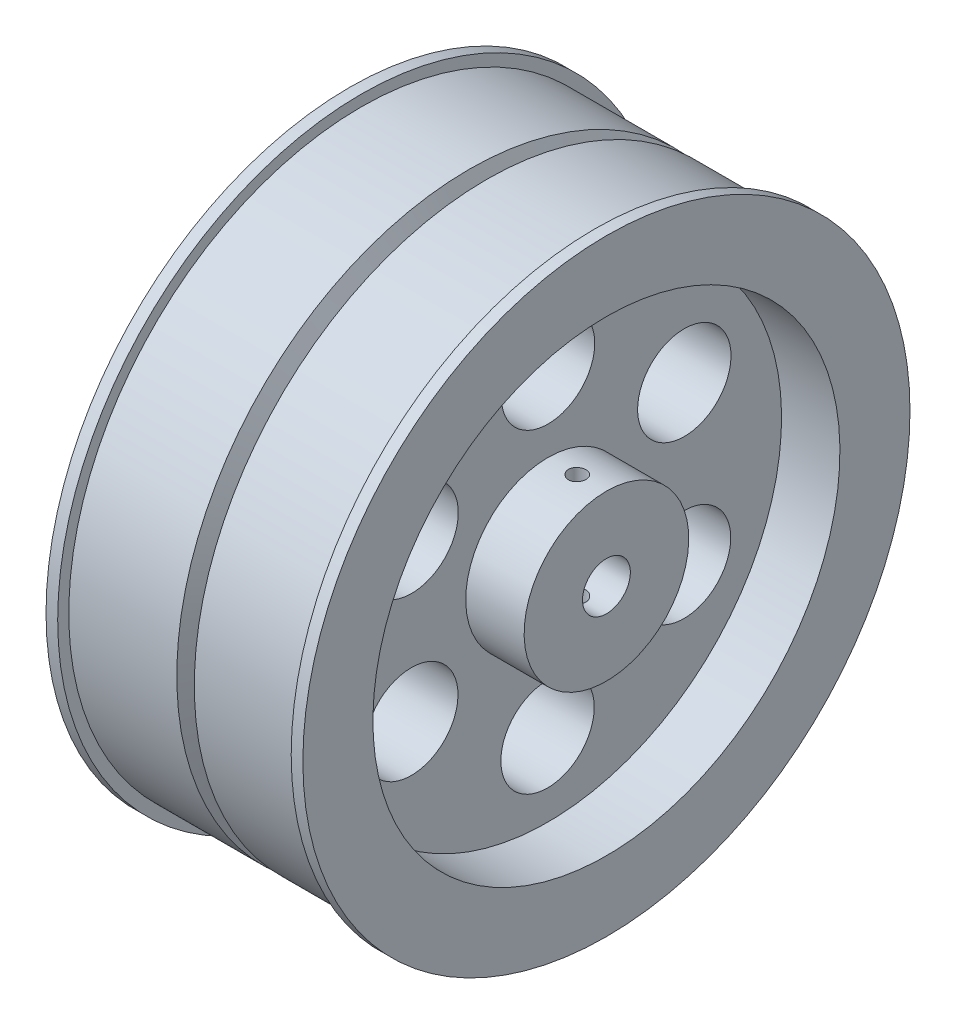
ISO-10303-21;
HEADER;
FILE_DESCRIPTION(('STEP AP214'),'2;1');
FILE_NAME('part.step','',(''),(''),'','','');
FILE_SCHEMA(('AUTOMOTIVE_DESIGN { 1 0 10303 214 1 1 1 1 }'));
ENDSEC;
DATA;
#1=APPLICATION_CONTEXT('core data for automotive mechanical design processes');
#2=APPLICATION_PROTOCOL_DEFINITION('international standard','automotive_design',2000,#1);
#3=PRODUCT_CONTEXT('',#1,'mechanical');
#4=PRODUCT('Part','Part','',(#3));
#5=PRODUCT_RELATED_PRODUCT_CATEGORY('part','',(#4));
#6=PRODUCT_DEFINITION_FORMATION('','',#4);
#7=PRODUCT_DEFINITION_CONTEXT('part definition',#1,'design');
#8=PRODUCT_DEFINITION('design','',#6,#7);
#9=PRODUCT_DEFINITION_SHAPE('','',#8);
#10=(LENGTH_UNIT() NAMED_UNIT(*) SI_UNIT(.MILLI.,.METRE.));
#11=(NAMED_UNIT(*) PLANE_ANGLE_UNIT() SI_UNIT($,.RADIAN.));
#12=(NAMED_UNIT(*) SI_UNIT($,.STERADIAN.) SOLID_ANGLE_UNIT());
#13=UNCERTAINTY_MEASURE_WITH_UNIT(LENGTH_MEASURE(1.E-05),#10,'distance_accuracy_value','');
#14=(GEOMETRIC_REPRESENTATION_CONTEXT(3) GLOBAL_UNCERTAINTY_ASSIGNED_CONTEXT((#13)) GLOBAL_UNIT_ASSIGNED_CONTEXT((#10,
#11,#12)) REPRESENTATION_CONTEXT('',''));
#15=CARTESIAN_POINT('',(0.,0.,0.));
#16=DIRECTION('',(0.,0.,1.));
#17=DIRECTION('',(1.,0.,0.));
#18=AXIS2_PLACEMENT_3D('',#15,#16,#17);
#19=CARTESIAN_POINT('',(44.,-4.09999999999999,0.));
#20=DIRECTION('',(1.,0.,0.));
#21=DIRECTION('',(0.,1.,0.));
#22=AXIS2_PLACEMENT_3D('',#19,#20,#21);
#23=CYLINDRICAL_SURFACE('',#22,4.1);
#24=CARTESIAN_POINT('',(39.0169354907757,-7.91575680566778,-1.5));
#25=CARTESIAN_POINT('',(39.0981031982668,-7.91575467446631,-1.50000235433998));
#26=CARTESIAN_POINT('',(39.1792549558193,-7.91837484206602,-1.49338979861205));
#27=CARTESIAN_POINT('',(39.339121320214,-7.92850330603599,-1.46722747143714));
#28=CARTESIAN_POINT('',(39.4178359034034,-7.93601164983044,-1.4476775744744));
#29=CARTESIAN_POINT('',(39.5704779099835,-7.95495455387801,-1.39644599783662));
#30=CARTESIAN_POINT('',(39.6444158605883,-7.96638010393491,-1.36479214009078));
#31=CARTESIAN_POINT('',(39.7859598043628,-7.991855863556,-1.29034903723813));
#32=CARTESIAN_POINT('',(39.8535639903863,-8.00590681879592,-1.24755662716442));
#33=CARTESIAN_POINT('',(39.9837165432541,-8.03579442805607,-1.14988485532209));
#34=CARTESIAN_POINT('',(40.0459229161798,-8.05168186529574,-1.09456519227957));
#35=CARTESIAN_POINT('',(40.1604148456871,-8.08302744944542,-0.97434468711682));
#36=CARTESIAN_POINT('',(40.21269841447,-8.0984855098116,-0.909441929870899));
#37=CARTESIAN_POINT('',(40.3074858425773,-8.12783066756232,-0.769323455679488));
#38=CARTESIAN_POINT('',(40.3496210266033,-8.14165123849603,-0.693843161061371));
#39=CARTESIAN_POINT('',(40.4204550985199,-8.16555657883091,-0.53627123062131));
#40=CARTESIAN_POINT('',(40.4491584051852,-8.17564257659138,-0.454181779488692));
#41=CARTESIAN_POINT('',(40.4911236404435,-8.1905820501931,-0.289315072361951));
#42=CARTESIAN_POINT('',(40.5049736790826,-8.19563420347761,-0.206705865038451));
#43=CARTESIAN_POINT('',(40.518720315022,-8.2006479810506,-0.0401915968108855));
#44=CARTESIAN_POINT('',(40.5186212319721,-8.20061118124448,0.0437130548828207));
#45=CARTESIAN_POINT('',(40.5048219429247,-8.19557948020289,0.206233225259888));
#46=CARTESIAN_POINT('',(40.4917629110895,-8.19081831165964,0.284911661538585));
#47=CARTESIAN_POINT('',(40.4534887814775,-8.17717640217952,0.438871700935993));
#48=CARTESIAN_POINT('',(40.4282728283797,-8.16829537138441,0.514153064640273));
#49=CARTESIAN_POINT('',(40.3660859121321,-8.14714008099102,0.660456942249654));
#50=CARTESIAN_POINT('',(40.328952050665,-8.13481912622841,0.731403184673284));
#51=CARTESIAN_POINT('',(40.2441250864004,-8.10803906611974,0.866230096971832));
#52=CARTESIAN_POINT('',(40.1964286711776,-8.09357929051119,0.930108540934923));
#53=CARTESIAN_POINT('',(40.0887080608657,-8.06306510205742,1.05277373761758));
#54=CARTESIAN_POINT('',(40.0281434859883,-8.04696673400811,1.11107573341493));
#55=CARTESIAN_POINT('',(39.8979899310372,-8.01564460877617,1.21687247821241));
#56=CARTESIAN_POINT('',(39.82839890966,-8.00042105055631,1.26436477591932));
#57=CARTESIAN_POINT('',(39.6803427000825,-7.97230316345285,1.34805926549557));
#58=CARTESIAN_POINT('',(39.6017264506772,-7.95946219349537,1.38401358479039));
#59=CARTESIAN_POINT('',(39.4389625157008,-7.93817916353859,1.44199376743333));
#60=CARTESIAN_POINT('',(39.3548177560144,-7.92973479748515,1.46402693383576));
#61=CARTESIAN_POINT('',(39.1881562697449,-7.91873991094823,1.49246340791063));
#62=CARTESIAN_POINT('',(39.1057893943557,-7.91590089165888,1.49963279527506));
#63=CARTESIAN_POINT('',(38.9409985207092,-7.9156236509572,1.50033939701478));
#64=CARTESIAN_POINT('',(38.8585745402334,-7.91818417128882,1.49387978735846));
#65=CARTESIAN_POINT('',(38.699832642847,-7.92812567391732,1.46820510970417));
#66=CARTESIAN_POINT('',(38.6234059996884,-7.93528801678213,1.44956796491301));
#67=CARTESIAN_POINT('',(38.4747947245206,-7.95337108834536,1.40078660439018));
#68=CARTESIAN_POINT('',(38.4026109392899,-7.9642925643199,1.37064010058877));
#69=CARTESIAN_POINT('',(38.2616249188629,-7.98915142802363,1.29846231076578));
#70=CARTESIAN_POINT('',(38.1930403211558,-8.00318384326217,1.25603958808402));
#71=CARTESIAN_POINT('',(38.0636900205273,-8.03251834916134,1.16093603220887));
#72=CARTESIAN_POINT('',(38.0029270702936,-8.04782088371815,1.10825160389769));
#73=CARTESIAN_POINT('',(37.8871779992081,-8.07907771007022,0.990388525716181));
#74=CARTESIAN_POINT('',(37.8327547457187,-8.09501624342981,0.924651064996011));
#75=CARTESIAN_POINT('',(37.7356516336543,-8.12486628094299,0.784583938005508));
#76=CARTESIAN_POINT('',(37.6929716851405,-8.13877780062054,0.7102543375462));
#77=CARTESIAN_POINT('',(37.6208807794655,-8.16298131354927,0.55524929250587));
#78=CARTESIAN_POINT('',(37.5914125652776,-8.17328888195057,0.474603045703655));
#79=CARTESIAN_POINT('',(37.546615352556,-8.18918053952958,0.309037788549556));
#80=CARTESIAN_POINT('',(37.5312800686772,-8.19476672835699,0.224120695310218));
#81=CARTESIAN_POINT('',(37.5158370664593,-8.20039636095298,0.0575246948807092));
#82=CARTESIAN_POINT('',(37.5149279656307,-8.20073149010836,-0.0240707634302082));
#83=CARTESIAN_POINT('',(37.5263210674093,-8.19657209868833,-0.18620018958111));
#84=CARTESIAN_POINT('',(37.5386218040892,-8.19207811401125,-0.266734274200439));
#85=CARTESIAN_POINT('',(37.5755281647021,-8.17889309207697,-0.422636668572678));
#86=CARTESIAN_POINT('',(37.599853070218,-8.17029795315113,-0.498080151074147));
#87=CARTESIAN_POINT('',(37.6598427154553,-8.1498035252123,-0.643827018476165));
#88=CARTESIAN_POINT('',(37.6955095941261,-8.13790361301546,-0.714129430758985));
#89=CARTESIAN_POINT('',(37.7788415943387,-8.11139072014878,-0.850756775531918));
#90=CARTESIAN_POINT('',(37.8269392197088,-8.09668640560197,-0.916799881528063));
#91=CARTESIAN_POINT('',(37.9330737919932,-8.06638021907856,-1.04012881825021));
#92=CARTESIAN_POINT('',(37.9911142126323,-8.05077803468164,-1.09741157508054));
#93=CARTESIAN_POINT('',(38.118915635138,-8.01949238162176,-1.20451181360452));
#94=CARTESIAN_POINT('',(38.1891153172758,-8.00384329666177,-1.25381781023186));
#95=CARTESIAN_POINT('',(38.3373000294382,-7.97512980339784,-1.33993960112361));
#96=CARTESIAN_POINT('',(38.4152851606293,-7.962065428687,-1.37675523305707));
#97=CARTESIAN_POINT('',(38.5788554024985,-7.93994967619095,-1.43731022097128));
#98=CARTESIAN_POINT('',(38.664574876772,-7.93099845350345,-1.46072632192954));
#99=CARTESIAN_POINT('',(38.8391823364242,-7.91890485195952,-1.49206547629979));
#100=CARTESIAN_POINT('',(38.9280684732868,-7.91575913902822,-1.49999742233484));
#101=CARTESIAN_POINT('',(39.0169354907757,-7.91575680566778,-1.5));
#102=B_SPLINE_CURVE_WITH_KNOTS('',3,(#24,#25,#26,#27,#28,#29,#30,#31,#32,#33,#34,#35,#36,#37,
#38,#39,#40,#41,#42,#43,#44,#45,#46,#47,#48,#49,#50,#51,#52,#53,#54,#55,#56,#57,#58,#59,#60,#61,
#62,#63,#64,#65,#66,#67,#68,#69,#70,#71,#72,#73,#74,#75,#76,#77,#78,#79,#80,#81,#82,#83,#84,#85,
#86,#87,#88,#89,#90,#91,#92,#93,#94,#95,#96,#97,#98,#99,#100,#101),.UNSPECIFIED.,.T.,.F.,(4,2,2,
2,2,2,2,2,2,2,2,2,2,2,2,2,2,2,2,2,2,2,2,2,2,2,2,2,2,2,2,2,2,2,2,2,2,2,4),(0.,0.243172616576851,
0.486347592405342,0.728966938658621,0.971655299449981,1.22477018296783,1.47793571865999,
1.73924469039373,2.00046763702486,2.25091526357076,2.5012853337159,2.73985669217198,
2.97844483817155,3.22044388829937,3.46251893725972,3.71813633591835,3.9738116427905,
4.23465998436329,4.4953713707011,4.74227312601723,4.98911735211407,5.22502305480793,
5.46097568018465,5.70548712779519,5.95008439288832,6.20931086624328,6.46853535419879,
6.7266252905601,6.98460039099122,7.22819130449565,7.47175518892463,7.70988376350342,
7.94805727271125,8.1960098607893,8.44404925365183,8.70439673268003,8.96474759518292,
9.23113982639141,9.49737902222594),.UNSPECIFIED.);
#103=CARTESIAN_POINT('',(39.0169354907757,-7.91575680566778,-1.5));
#104=VERTEX_POINT('',#103);
#105=EDGE_CURVE('E86',#104,#104,#102,.T.);
#106=ORIENTED_EDGE('',*,*,#105,.T.);
#107=EDGE_LOOP('',(#106));
#108=FACE_BOUND('',#107,.T.);
#109=CARTESIAN_POINT('',(44.,-4.09999999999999,0.));
#110=DIRECTION('',(1.,0.,0.));
#111=DIRECTION('',(0.,1.,0.));
#112=AXIS2_PLACEMENT_3D('',#109,#110,#111);
#113=CIRCLE('',#112,4.1);
#114=CARTESIAN_POINT('',(44.,0.,0.));
#115=VERTEX_POINT('',#114);
#116=EDGE_CURVE('E147',#115,#115,#113,.T.);
#117=ORIENTED_EDGE('',*,*,#116,.T.);
#118=EDGE_LOOP('',(#117));
#119=FACE_BOUND('',#118,.T.);
#120=CARTESIAN_POINT('',(0.,-4.1,0.));
#121=DIRECTION('',(1.,0.,0.));
#122=DIRECTION('',(0.,1.,0.));
#123=AXIS2_PLACEMENT_3D('',#120,#121,#122);
#124=CIRCLE('',#123,4.1);
#125=CARTESIAN_POINT('',(0.,0.,0.));
#126=VERTEX_POINT('',#125);
#127=EDGE_CURVE('E57',#126,#126,#124,.T.);
#128=ORIENTED_EDGE('',*,*,#127,.F.);
#129=EDGE_LOOP('',(#128));
#130=FACE_BOUND('',#129,.T.);
#131=CARTESIAN_POINT('',(37.5169354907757,0.,0.));
#132=CARTESIAN_POINT('',(37.5169332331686,1.65923337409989E-06,0.0813740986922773));
#133=CARTESIAN_POINT('',(37.5235781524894,-0.0024439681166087,0.162732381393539));
#134=CARTESIAN_POINT('',(37.5498807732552,-0.0119565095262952,0.323025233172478));
#135=CARTESIAN_POINT('',(37.5695373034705,-0.0190230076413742,0.401960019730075));
#136=CARTESIAN_POINT('',(37.6210801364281,-0.0370166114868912,0.555071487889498));
#137=CARTESIAN_POINT('',(37.6529435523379,-0.047936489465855,0.629256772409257));
#138=CARTESIAN_POINT('',(37.7278822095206,-0.0725431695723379,0.771225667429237));
#139=CARTESIAN_POINT('',(37.7709602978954,-0.0862306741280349,0.839007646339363));
#140=CARTESIAN_POINT('',(37.868939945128,-0.115576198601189,0.969005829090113));
#141=CARTESIAN_POINT('',(37.9242174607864,-0.131288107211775,1.03092640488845));
#142=CARTESIAN_POINT('',(38.0442285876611,-0.162639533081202,1.14485387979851));
#143=CARTESIAN_POINT('',(38.1089648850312,-0.178279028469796,1.196857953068));
#144=CARTESIAN_POINT('',(38.2488921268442,-0.208333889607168,1.29131121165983));
#145=CARTESIAN_POINT('',(38.3243749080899,-0.222685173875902,1.333350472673));
#146=CARTESIAN_POINT('',(38.4819477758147,-0.247704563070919,1.40400686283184));
#147=CARTESIAN_POINT('',(38.5640353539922,-0.258374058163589,1.43262905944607));
#148=CARTESIAN_POINT('',(38.7290923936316,-0.274247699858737,1.47448484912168));
#149=CARTESIAN_POINT('',(38.8118995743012,-0.279650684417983,1.48828050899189));
#150=CARTESIAN_POINT('',(38.9788162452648,-0.284962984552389,1.50184918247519));
#151=CARTESIAN_POINT('',(39.0629252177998,-0.284874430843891,1.50162763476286));
#152=CARTESIAN_POINT('',(39.2249991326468,-0.279385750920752,1.48759945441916));
#153=CARTESIAN_POINT('',(39.3030426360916,-0.2742861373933,1.47456140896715));
#154=CARTESIAN_POINT('',(39.455745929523,-0.259847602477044,1.43653709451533));
#155=CARTESIAN_POINT('',(39.5304052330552,-0.250508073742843,1.41154911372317));
#156=CARTESIAN_POINT('',(39.6758278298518,-0.22845373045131,1.34989422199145));
#157=CARTESIAN_POINT('',(39.7464946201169,-0.215680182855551,1.31302162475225));
#158=CARTESIAN_POINT('',(39.8808653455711,-0.188217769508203,1.22878734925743));
#159=CARTESIAN_POINT('',(39.9445669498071,-0.173528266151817,1.18142217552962));
#160=CARTESIAN_POINT('',(40.0674688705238,-0.142746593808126,1.0739910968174));
#161=CARTESIAN_POINT('',(40.1261236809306,-0.126624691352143,1.01330819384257));
#162=CARTESIAN_POINT('',(40.2325820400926,-0.0956026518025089,0.882778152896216));
#163=CARTESIAN_POINT('',(40.2803840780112,-0.0807026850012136,0.812929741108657));
#164=CARTESIAN_POINT('',(40.3643431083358,-0.0535320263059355,0.664714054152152));
#165=CARTESIAN_POINT('',(40.4003266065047,-0.0413013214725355,0.586240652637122));
#166=CARTESIAN_POINT('',(40.4584028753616,-0.0211421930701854,0.423796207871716));
#167=CARTESIAN_POINT('',(40.4805015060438,-0.013211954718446,0.339827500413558));
#168=CARTESIAN_POINT('',(40.5091509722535,-0.00286211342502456,0.173373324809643));
#169=CARTESIAN_POINT('',(40.5164369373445,-0.000182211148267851,0.0910304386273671));
#170=CARTESIAN_POINT('',(40.5173841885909,0.000163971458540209,-0.0737349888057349));
#171=CARTESIAN_POINT('',(40.5110483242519,-0.00216869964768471,-0.156157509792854));
#172=CARTESIAN_POINT('',(40.4854962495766,-0.0114136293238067,-0.31561968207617));
#173=CARTESIAN_POINT('',(40.4667546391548,-0.0181570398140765,-0.3927461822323));
#174=CARTESIAN_POINT('',(40.417540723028,-0.0353762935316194,-0.542711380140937));
#175=CARTESIAN_POINT('',(40.3870668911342,-0.0458526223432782,-0.615549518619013));
#176=CARTESIAN_POINT('',(40.3142957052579,-0.0698718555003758,-0.757219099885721));
#177=CARTESIAN_POINT('',(40.2716829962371,-0.0834944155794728,-0.825874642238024));
#178=CARTESIAN_POINT('',(40.1762030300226,-0.112289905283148,-0.955285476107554));
#179=CARTESIAN_POINT('',(40.1233321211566,-0.127463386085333,-1.01603794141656));
#180=CARTESIAN_POINT('',(40.0054004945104,-0.158723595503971,-1.13141965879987));
#181=CARTESIAN_POINT('',(39.9398282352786,-0.174814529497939,-1.18552627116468));
#182=CARTESIAN_POINT('',(39.8002099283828,-0.2052745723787,-1.28206233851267));
#183=CARTESIAN_POINT('',(39.7261633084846,-0.219643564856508,-1.3244910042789));
#184=CARTESIAN_POINT('',(39.5712398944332,-0.244949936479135,-1.39644382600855));
#185=CARTESIAN_POINT('',(39.4903465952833,-0.255878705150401,-1.42593567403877));
#186=CARTESIAN_POINT('',(39.3242344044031,-0.272777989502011,-1.47069890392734));
#187=CARTESIAN_POINT('',(39.2390180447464,-0.278751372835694,-1.48597851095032));
#188=CARTESIAN_POINT('',(39.0723108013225,-0.284694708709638,-1.50116808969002));
#189=CARTESIAN_POINT('',(38.9909122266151,-0.285010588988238,-1.50196373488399));
#190=CARTESIAN_POINT('',(38.829207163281,-0.280482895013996,-1.4904116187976));
#191=CARTESIAN_POINT('',(38.7489005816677,-0.275639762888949,-1.47806498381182));
#192=CARTESIAN_POINT('',(38.5939030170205,-0.261621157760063,-1.44125524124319));
#193=CARTESIAN_POINT('',(38.5191181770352,-0.252569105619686,-1.41713639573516));
#194=CARTESIAN_POINT('',(38.3746089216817,-0.231218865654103,-1.35776394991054));
#195=CARTESIAN_POINT('',(38.3048857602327,-0.218919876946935,-1.32250760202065));
#196=CARTESIAN_POINT('',(38.1686499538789,-0.191687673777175,-1.23979005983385));
#197=CARTESIAN_POINT('',(38.1024777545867,-0.176652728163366,-1.19180200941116));
#198=CARTESIAN_POINT('',(37.9788415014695,-0.146009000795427,-1.08581555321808));
#199=CARTESIAN_POINT('',(37.9213801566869,-0.130400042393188,-1.02781404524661));
#200=CARTESIAN_POINT('',(37.81384545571,-0.0994203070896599,-0.899942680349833));
#201=CARTESIAN_POINT('',(37.7642916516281,-0.0841013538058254,-0.82962142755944));
#202=CARTESIAN_POINT('',(37.6777321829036,-0.0562664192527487,-0.681116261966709));
#203=CARTESIAN_POINT('',(37.6407264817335,-0.0437504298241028,-0.602932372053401));
#204=CARTESIAN_POINT('',(37.5798828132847,-0.022711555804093,-0.438970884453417));
#205=CARTESIAN_POINT('',(37.5563673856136,-0.0142871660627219,-0.353059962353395));
#206=CARTESIAN_POINT('',(37.524898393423,-0.00293350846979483,-0.178092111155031));
#207=CARTESIAN_POINT('',(37.5169379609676,-1.81547298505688E-06,-0.0890365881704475));
#208=CARTESIAN_POINT('',(37.5169354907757,0.,0.));
#209=B_SPLINE_CURVE_WITH_KNOTS('',3,(#131,#132,#133,#134,#135,#136,#137,#138,#139,#140,#141,
#142,#143,#144,#145,#146,#147,#148,#149,#150,#151,#152,#153,#154,#155,#156,#157,#158,#159,#160,
#161,#162,#163,#164,#165,#166,#167,#168,#169,#170,#171,#172,#173,#174,#175,#176,#177,#178,#179,
#180,#181,#182,#183,#184,#185,#186,#187,#188,#189,#190,#191,#192,#193,#194,#195,#196,#197,#198,
#199,#200,#201,#202,#203,#204,#205,#206,#207,#208),.UNSPECIFIED.,.T.,.F.,(4,2,2,2,2,2,2,2,2,2,2,
2,2,2,2,2,2,2,2,2,2,2,2,2,2,2,2,2,2,2,2,2,2,2,2,2,2,2,4),(0.,0.243794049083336,
0.487566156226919,0.730883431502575,0.97426253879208,1.22657525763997,1.4789597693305,
1.74040261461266,2.00174663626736,2.25278996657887,2.50373589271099,2.74049742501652,
2.97729288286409,3.21842895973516,3.45964548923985,3.71623310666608,3.97285642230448,
4.23309408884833,4.49322185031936,4.74008954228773,4.98690559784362,5.22478638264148,
5.46269812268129,5.70746441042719,5.95231798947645,6.21067838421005,6.46905623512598,
6.72807572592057,6.9869452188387,7.22992815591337,7.47289027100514,7.70913823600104,
7.94544452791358,8.1936958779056,8.44202427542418,8.70289171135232,8.9637583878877,
9.2306268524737,9.49737746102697),.UNSPECIFIED.);
#210=CARTESIAN_POINT('',(37.5169354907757,0.,0.));
#211=VERTEX_POINT('',#210);
#212=EDGE_CURVE('E92',#211,#211,#209,.T.);
#213=ORIENTED_EDGE('',*,*,#212,.T.);
#214=EDGE_LOOP('',(#213));
#215=FACE_BOUND('',#214,.T.);
#216=ADVANCED_FACE('F43',(#108,#119,#130,#215),#23,.F.);
#217=CARTESIAN_POINT('',(44.,-4.09999999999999,0.));
#218=DIRECTION('',(1.,0.,0.));
#219=DIRECTION('',(0.,1.,0.));
#220=AXIS2_PLACEMENT_3D('',#217,#218,#219);
#221=CYLINDRICAL_SURFACE('',#220,14.1);
#222=CARTESIAN_POINT('',(37.5169354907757,10.,0.));
#223=CARTESIAN_POINT('',(37.516939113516,9.99999897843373,-0.0840010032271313));
#224=CARTESIAN_POINT('',(37.52401542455,9.99924137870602,-0.168056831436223));
#225=CARTESIAN_POINT('',(37.5521362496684,9.99629201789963,-0.33383610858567));
#226=CARTESIAN_POINT('',(37.5731959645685,9.99409869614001,-0.415556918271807));
#227=CARTESIAN_POINT('',(37.6286618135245,9.98852536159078,-0.574241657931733));
#228=CARTESIAN_POINT('',(37.6630596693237,9.98514608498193,-0.651208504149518));
#229=CARTESIAN_POINT('',(37.7442088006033,9.97757822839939,-0.798260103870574));
#230=CARTESIAN_POINT('',(37.7909576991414,9.97338980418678,-0.86834617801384));
#231=CARTESIAN_POINT('',(37.8956847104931,9.96465351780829,-0.999946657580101));
#232=CARTESIAN_POINT('',(37.9537026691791,9.96010441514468,-1.06142927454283));
#233=CARTESIAN_POINT('',(38.0792357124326,9.9511696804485,-1.17380421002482));
#234=CARTESIAN_POINT('',(38.146751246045,9.9467840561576,-1.22469602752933));
#235=CARTESIAN_POINT('',(38.2895638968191,9.93866029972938,-1.31455885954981));
#236=CARTESIAN_POINT('',(38.3648793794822,9.93492375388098,-1.35350084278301));
#237=CARTESIAN_POINT('',(38.5210269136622,9.92853688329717,-1.41817321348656));
#238=CARTESIAN_POINT('',(38.6018588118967,9.92588652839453,-1.44390396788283));
#239=CARTESIAN_POINT('',(38.7664188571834,9.92198352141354,-1.48132861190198));
#240=CARTESIAN_POINT('',(38.8501348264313,9.92072559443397,-1.49307548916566));
#241=CARTESIAN_POINT('',(39.0183587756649,9.91973356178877,-1.50236276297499));
#242=CARTESIAN_POINT('',(39.1028667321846,9.91999941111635,-1.49990357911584));
#243=CARTESIAN_POINT('',(39.2699095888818,9.92202007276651,-1.48089216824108));
#244=CARTESIAN_POINT('',(39.352451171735,9.9237687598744,-1.46439791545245));
#245=CARTESIAN_POINT('',(39.513587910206,9.92854850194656,-1.41787484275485));
#246=CARTESIAN_POINT('',(39.5921830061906,9.93157957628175,-1.38784581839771));
#247=CARTESIAN_POINT('',(39.7433781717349,9.93858959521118,-1.31504201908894));
#248=CARTESIAN_POINT('',(39.8159658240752,9.94257044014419,-1.27224164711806));
#249=CARTESIAN_POINT('',(39.9529496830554,9.95102989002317,-1.17512847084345));
#250=CARTESIAN_POINT('',(40.0173456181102,9.95550851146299,-1.12081528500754));
#251=CARTESIAN_POINT('',(40.1364548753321,9.96448617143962,-1.00189501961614));
#252=CARTESIAN_POINT('',(40.1911182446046,9.96898520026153,-0.9372378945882));
#253=CARTESIAN_POINT('',(40.2888230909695,9.97747568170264,-0.799638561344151));
#254=CARTESIAN_POINT('',(40.3318645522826,9.9814671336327,-0.726696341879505));
#255=CARTESIAN_POINT('',(40.4051022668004,9.98849429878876,-0.574561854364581));
#256=CARTESIAN_POINT('',(40.4352958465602,9.99152981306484,-0.495368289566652));
#257=CARTESIAN_POINT('',(40.4819433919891,9.99630111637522,-0.332996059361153));
#258=CARTESIAN_POINT('',(40.4983978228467,9.99803694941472,-0.249817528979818));
#259=CARTESIAN_POINT('',(40.5170362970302,10.0000076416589,-0.0822689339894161));
#260=CARTESIAN_POINT('',(40.519289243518,10.0002497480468,0.00209338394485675));
#261=CARTESIAN_POINT('',(40.5096419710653,9.99922517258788,0.169994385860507));
#262=CARTESIAN_POINT('',(40.4977419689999,9.99795851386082,0.253533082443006));
#263=CARTESIAN_POINT('',(40.4601837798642,9.99406334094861,0.417215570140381));
#264=CARTESIAN_POINT('',(40.4345579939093,9.99143803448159,0.497366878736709));
#265=CARTESIAN_POINT('',(40.3703090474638,9.98511993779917,0.652233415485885));
#266=CARTESIAN_POINT('',(40.3316855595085,9.98142712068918,0.726948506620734));
#267=CARTESIAN_POINT('',(40.242367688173,9.97336866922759,0.869132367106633));
#268=CARTESIAN_POINT('',(40.1916281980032,9.96900054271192,0.936572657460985));
#269=CARTESIAN_POINT('',(40.0795831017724,9.96008923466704,1.0620039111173));
#270=CARTESIAN_POINT('',(40.0182771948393,9.95554604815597,1.11999460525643));
#271=CARTESIAN_POINT('',(39.8865381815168,9.94677472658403,1.22512099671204));
#272=CARTESIAN_POINT('',(39.8160687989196,9.94254795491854,1.2722113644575));
#273=CARTESIAN_POINT('',(39.6681814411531,9.93490919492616,1.35388840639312));
#274=CARTESIAN_POINT('',(39.5907635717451,9.93149719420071,1.38847527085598));
#275=CARTESIAN_POINT('',(39.4313301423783,9.92588301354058,1.44408820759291));
#276=CARTESIAN_POINT('',(39.3493239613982,9.92367845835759,1.46514091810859));
#277=CARTESIAN_POINT('',(39.1829158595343,9.92072154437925,1.49317422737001));
#278=CARTESIAN_POINT('',(39.0985140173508,9.91996913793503,1.50015528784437));
#279=CARTESIAN_POINT('',(38.930161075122,9.920002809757,1.49984024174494));
#280=CARTESIAN_POINT('',(38.8462098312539,9.92078121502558,1.49261534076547));
#281=CARTESIAN_POINT('',(38.6807211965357,9.92377241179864,1.46424310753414));
#282=CARTESIAN_POINT('',(38.5991838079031,9.92598520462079,1.4430957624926));
#283=CARTESIAN_POINT('',(38.4408400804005,9.93159366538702,1.38749922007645));
#284=CARTESIAN_POINT('',(38.3640328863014,9.93498911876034,1.35305243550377));
#285=CARTESIAN_POINT('',(38.2172786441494,9.94258073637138,1.27184204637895));
#286=CARTESIAN_POINT('',(38.1473315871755,9.94677689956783,1.22507845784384));
#287=CARTESIAN_POINT('',(38.0159183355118,9.95552234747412,1.12029507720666));
#288=CARTESIAN_POINT('',(37.9544945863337,9.96007323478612,1.06222218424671));
#289=CARTESIAN_POINT('',(37.8422338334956,9.96900081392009,0.936575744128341));
#290=CARTESIAN_POINT('',(37.7913993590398,9.97337746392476,0.868999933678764));
#291=CARTESIAN_POINT('',(37.7016450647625,9.98147646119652,0.726055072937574));
#292=CARTESIAN_POINT('',(37.6627591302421,9.98519693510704,0.65066465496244));
#293=CARTESIAN_POINT('',(37.5982513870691,9.99154445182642,0.494431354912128));
#294=CARTESIAN_POINT('',(37.5726147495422,9.99417271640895,0.413594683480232));
#295=CARTESIAN_POINT('',(37.5416663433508,9.99738552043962,0.27692434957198));
#296=CARTESIAN_POINT('',(37.5324050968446,9.99836133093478,0.221961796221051));
#297=CARTESIAN_POINT('',(37.5200384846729,9.9996689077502,0.11134085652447));
#298=CARTESIAN_POINT('',(37.5169330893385,10.0000006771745,0.0556824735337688));
#299=CARTESIAN_POINT('',(37.5169354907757,10.,0.));
#300=B_SPLINE_CURVE_WITH_KNOTS('',3,(#222,#223,#224,#225,#226,#227,#228,#229,#230,#231,#232,
#233,#234,#235,#236,#237,#238,#239,#240,#241,#242,#243,#244,#245,#246,#247,#248,#249,#250,#251,
#252,#253,#254,#255,#256,#257,#258,#259,#260,#261,#262,#263,#264,#265,#266,#267,#268,#269,#270,
#271,#272,#273,#274,#275,#276,#277,#278,#279,#280,#281,#282,#283,#284,#285,#286,#287,#288,#289,
#290,#291,#292,#293,#294,#295,#296,#297,#298,#299),.UNSPECIFIED.,.T.,.F.,(4,2,2,2,2,2,2,2,2,2,2,
2,2,2,2,2,2,2,2,2,2,2,2,2,2,2,2,2,2,2,2,2,2,2,2,2,2,2,4),(0.,0.251799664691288,
0.503873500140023,0.755791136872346,1.00766032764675,1.2604368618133,1.51322535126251,
1.76662319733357,2.02001400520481,2.27244157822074,2.52486169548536,2.77624418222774,
3.02763046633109,3.2795240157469,3.53142591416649,3.78458561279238,4.03774565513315,
4.2909583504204,4.54416247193,4.79613713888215,5.04810794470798,5.29948655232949,
5.55087149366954,5.80320732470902,6.05555034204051,6.30892460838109,6.56229501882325,
6.81516520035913,7.0680270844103,7.319624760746,7.57122266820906,7.82277495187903,
8.07432690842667,8.32708977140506,8.57991293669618,8.83344661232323,9.08669591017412,
9.2536093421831,9.42052196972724),.UNSPECIFIED.);
#301=CARTESIAN_POINT('',(37.5169354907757,10.,0.));
#302=VERTEX_POINT('',#301);
#303=EDGE_CURVE('E10',#302,#302,#300,.T.);
#304=ORIENTED_EDGE('',*,*,#303,.T.);
#305=EDGE_LOOP('',(#304));
#306=FACE_BOUND('',#305,.T.);
#307=CARTESIAN_POINT('',(44.,-4.09999999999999,0.));
#308=DIRECTION('',(1.,0.,0.));
#309=DIRECTION('',(0.,1.,0.));
#310=AXIS2_PLACEMENT_3D('',#307,#308,#309);
#311=CIRCLE('',#310,14.1);
#312=CARTESIAN_POINT('',(44.,10.,0.));
#313=VERTEX_POINT('',#312);
#314=EDGE_CURVE('E151',#313,#313,#311,.T.);
#315=ORIENTED_EDGE('',*,*,#314,.F.);
#316=EDGE_LOOP('',(#315));
#317=FACE_BOUND('',#316,.T.);
#318=CARTESIAN_POINT('',(34.,-4.1,0.));
#319=DIRECTION('',(1.,0.,0.));
#320=DIRECTION('',(0.,1.,0.));
#321=AXIS2_PLACEMENT_3D('',#318,#319,#320);
#322=CIRCLE('',#321,14.1);
#323=CARTESIAN_POINT('',(34.,10.,0.));
#324=VERTEX_POINT('',#323);
#325=EDGE_CURVE('E155',#324,#324,#322,.T.);
#326=ORIENTED_EDGE('',*,*,#325,.T.);
#327=EDGE_LOOP('',(#326));
#328=FACE_BOUND('',#327,.T.);
#329=CARTESIAN_POINT('',(39.0169354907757,-18.1199857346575,-1.5));
#330=CARTESIAN_POINT('',(38.9329360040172,-18.1199867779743,-1.49999637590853));
#331=CARTESIAN_POINT('',(38.8488816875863,-18.1207487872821,-1.49292031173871));
#332=CARTESIAN_POINT('',(38.6831055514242,-18.1237138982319,-1.4648005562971));
#333=CARTESIAN_POINT('',(38.6013863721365,-18.1259185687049,-1.44374165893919));
#334=CARTESIAN_POINT('',(38.4427050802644,-18.1315165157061,-1.38827820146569));
#335=CARTESIAN_POINT('',(38.3657400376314,-18.1349090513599,-1.35388195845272));
#336=CARTESIAN_POINT('',(38.2186914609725,-18.1424995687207,-1.27273662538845));
#337=CARTESIAN_POINT('',(38.1486066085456,-18.1466973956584,-1.22598990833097));
#338=CARTESIAN_POINT('',(38.0170047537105,-18.1554447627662,-1.12126510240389));
#339=CARTESIAN_POINT('',(37.9555199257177,-18.1599955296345,-1.06324668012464));
#340=CARTESIAN_POINT('',(37.8431407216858,-18.168924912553,-0.937711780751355));
#341=CARTESIAN_POINT('',(37.7922468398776,-18.1733035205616,-0.870194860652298));
#342=CARTESIAN_POINT('',(37.7023818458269,-18.181407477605,-0.727380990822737));
#343=CARTESIAN_POINT('',(37.6634393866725,-18.1851312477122,-0.652065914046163));
#344=CARTESIAN_POINT('',(37.5987660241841,-18.1914925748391,-0.495919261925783));
#345=CARTESIAN_POINT('',(37.5730347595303,-18.194130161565,-0.415087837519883));
#346=CARTESIAN_POINT('',(37.535609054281,-18.1980133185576,-0.250529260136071));
#347=CARTESIAN_POINT('',(37.5238615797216,-18.1992641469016,-0.166814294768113));
#348=CARTESIAN_POINT('',(37.5145727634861,-18.2002507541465,0.00140768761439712));
#349=CARTESIAN_POINT('',(37.5170310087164,-18.1999865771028,0.0859146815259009));
#350=CARTESIAN_POINT('',(37.536040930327,-18.1979772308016,0.252961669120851));
#351=CARTESIAN_POINT('',(37.5525355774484,-18.1962380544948,0.335508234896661));
#352=CARTESIAN_POINT('',(37.5990611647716,-18.1914809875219,0.496654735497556));
#353=CARTESIAN_POINT('',(37.6290923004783,-18.1884630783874,0.57525461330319));
#354=CARTESIAN_POINT('',(37.7019004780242,-18.1814774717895,0.726455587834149));
#355=CARTESIAN_POINT('',(37.74470262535,-18.1775079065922,0.799044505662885));
#356=CARTESIAN_POINT('',(37.84181959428,-18.1690641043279,0.936030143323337));
#357=CARTESIAN_POINT('',(37.8961347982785,-18.1645898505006,1.00042659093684));
#358=CARTESIAN_POINT('',(38.0150564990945,-18.1556123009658,1.11953358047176));
#359=CARTESIAN_POINT('',(38.0797126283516,-18.151108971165,1.17419457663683));
#360=CARTESIAN_POINT('',(38.2173091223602,-18.1426028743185,1.27189510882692));
#361=CARTESIAN_POINT('',(38.2902495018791,-18.1386001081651,1.31493462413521));
#362=CARTESIAN_POINT('',(38.4423834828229,-18.1315480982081,1.38817093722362));
#363=CARTESIAN_POINT('',(38.5215786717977,-18.1284990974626,1.41836446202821));
#364=CARTESIAN_POINT('',(38.6839544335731,-18.1237048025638,1.46501140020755));
#365=CARTESIAN_POINT('',(38.7671348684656,-18.1219594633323,1.48146528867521));
#366=CARTESIAN_POINT('',(38.9346843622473,-18.1199780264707,1.50010171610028));
#367=CARTESIAN_POINT('',(39.019045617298,-18.1197345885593,1.5023536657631));
#368=CARTESIAN_POINT('',(39.1869442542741,-18.1207651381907,1.49270477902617));
#369=CARTESIAN_POINT('',(39.2704816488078,-18.1220391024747,1.4808041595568));
#370=CARTESIAN_POINT('',(39.4341575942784,-18.1259542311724,1.44324610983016));
#371=CARTESIAN_POINT('',(39.5143038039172,-18.1285921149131,1.41762168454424));
#372=CARTESIAN_POINT('',(39.6691607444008,-18.1349352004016,1.35337716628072));
#373=CARTESIAN_POINT('',(39.7438713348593,-18.1386404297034,1.3147567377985));
#374=CARTESIAN_POINT('',(39.8860521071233,-18.1467184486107,1.22544338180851));
#375=CARTESIAN_POINT('',(39.9534933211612,-18.1510937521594,1.17470457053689));
#376=CARTESIAN_POINT('',(40.0789267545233,-18.1600107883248,1.06266028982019));
#377=CARTESIAN_POINT('',(40.1369187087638,-18.1645525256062,1.0013545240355));
#378=CARTESIAN_POINT('',(40.2420478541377,-18.1733129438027,0.869614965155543));
#379=CARTESIAN_POINT('',(40.2891396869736,-18.1775302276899,0.799144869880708));
#380=CARTESIAN_POINT('',(40.3708192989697,-18.1851461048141,0.651255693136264));
#381=CARTESIAN_POINT('',(40.4054072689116,-18.1885447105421,0.573836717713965));
#382=CARTESIAN_POINT('',(40.4610209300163,-18.1941340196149,0.414403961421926));
#383=CARTESIAN_POINT('',(40.4820737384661,-18.1963271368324,0.332399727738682));
#384=CARTESIAN_POINT('',(40.5101079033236,-18.1992682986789,0.165995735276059));
#385=CARTESIAN_POINT('',(40.5170897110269,-18.200016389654,0.0815960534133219));
#386=CARTESIAN_POINT('',(40.5167768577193,-18.1999831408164,-0.0867581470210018));
#387=CARTESIAN_POINT('',(40.5095524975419,-18.1992093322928,-0.17071280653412));
#388=CARTESIAN_POINT('',(40.4811801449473,-18.1962341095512,-0.336208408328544));
#389=CARTESIAN_POINT('',(40.4600321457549,-18.1940326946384,-0.417749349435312));
#390=CARTESIAN_POINT('',(40.4044329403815,-18.1884487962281,-0.576100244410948));
#391=CARTESIAN_POINT('',(40.3699841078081,-18.1850665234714,-0.652911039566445));
#392=CARTESIAN_POINT('',(40.2887685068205,-18.1774973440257,-0.799671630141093));
#393=CARTESIAN_POINT('',(40.2420017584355,-18.1733104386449,-0.86962143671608));
#394=CARTESIAN_POINT('',(40.137214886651,-18.1645758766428,-1.00103456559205));
#395=CARTESIAN_POINT('',(40.0791423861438,-18.1600266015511,-1.06245601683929));
#396=CARTESIAN_POINT('',(39.9534976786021,-18.1510935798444,-1.17471231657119));
#397=CARTESIAN_POINT('',(39.8859232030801,-18.1467098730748,-1.22554462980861));
#398=CARTESIAN_POINT('',(39.7429794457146,-18.138591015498,-1.3152965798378));
#399=CARTESIAN_POINT('',(39.6675885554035,-18.1348577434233,-1.3541819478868));
#400=CARTESIAN_POINT('',(39.5113542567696,-18.128484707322,-1.41868850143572));
#401=CARTESIAN_POINT('',(39.4305170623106,-18.1258437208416,-1.44432452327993));
#402=CARTESIAN_POINT('',(39.2938483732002,-18.1226145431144,-1.47527120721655));
#403=CARTESIAN_POINT('',(39.2388881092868,-18.1216334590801,-1.48453167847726));
#404=CARTESIAN_POINT('',(39.1282717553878,-18.1203187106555,-1.49689726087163));
#405=CARTESIAN_POINT('',(39.0726156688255,-18.1199850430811,-1.50000240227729));
#406=CARTESIAN_POINT('',(39.0169354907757,-18.1199857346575,-1.5));
#407=B_SPLINE_CURVE_WITH_KNOTS('',3,(#329,#330,#331,#332,#333,#334,#335,#336,#337,#338,#339,
#340,#341,#342,#343,#344,#345,#346,#347,#348,#349,#350,#351,#352,#353,#354,#355,#356,#357,#358,
#359,#360,#361,#362,#363,#364,#365,#366,#367,#368,#369,#370,#371,#372,#373,#374,#375,#376,#377,
#378,#379,#380,#381,#382,#383,#384,#385,#386,#387,#388,#389,#390,#391,#392,#393,#394,#395,#396,
#397,#398,#399,#400,#401,#402,#403,#404,#405,#406),.UNSPECIFIED.,.T.,.F.,(4,2,2,2,2,2,2,2,2,2,2,
2,2,2,2,2,2,2,2,2,2,2,2,2,2,2,2,2,2,2,2,2,2,2,2,2,2,2,4),(0.,0.251795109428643,
0.503864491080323,0.755776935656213,1.00764101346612,1.26042350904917,1.51321779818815,
1.76661350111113,2.02000227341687,2.27242696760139,2.52484432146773,2.77624098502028,
3.02764127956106,3.279539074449,3.5314452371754,3.7845988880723,4.03775299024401,
4.29097155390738,4.54418136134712,4.79615266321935,5.04812010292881,5.2994842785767,
5.55085494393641,5.8031928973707,6.05553792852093,6.3089148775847,6.56228796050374,
6.81515182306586,7.06800757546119,7.31961519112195,7.57122292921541,7.82278578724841,
8.07434823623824,8.32710511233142,8.57992243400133,8.83345831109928,9.08670966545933,
9.25361622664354,9.42052196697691),.UNSPECIFIED.);
#408=CARTESIAN_POINT('',(39.0169354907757,-18.1199857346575,-1.5));
#409=VERTEX_POINT('',#408);
#410=EDGE_CURVE('E47',#409,#409,#407,.T.);
#411=ORIENTED_EDGE('',*,*,#410,.T.);
#412=EDGE_LOOP('',(#411));
#413=FACE_BOUND('',#412,.T.);
#414=ADVANCED_FACE('F68',(#306,#317,#328,#413),#221,.T.);
#415=CARTESIAN_POINT('',(0.,0.,0.));
#416=DIRECTION('',(-1.,0.,0.));
#417=DIRECTION('',(0.,-1.,0.));
#418=AXIS2_PLACEMENT_3D('',#415,#416,#417);
#419=PLANE('',#418);
#420=ORIENTED_EDGE('',*,*,#127,.T.);
#421=EDGE_LOOP('',(#420));
#422=FACE_BOUND('',#421,.T.);
#423=CARTESIAN_POINT('',(0.,-4.1,0.));
#424=DIRECTION('',(1.,0.,0.));
#425=DIRECTION('',(0.,1.,0.));
#426=AXIS2_PLACEMENT_3D('',#423,#424,#425);
#427=CIRCLE('',#426,14.1);
#428=CARTESIAN_POINT('',(0.,10.,0.));
#429=VERTEX_POINT('',#428);
#430=EDGE_CURVE('E62',#429,#429,#427,.T.);
#431=ORIENTED_EDGE('',*,*,#430,.F.);
#432=EDGE_LOOP('',(#431));
#433=FACE_BOUND('',#432,.T.);
#434=ADVANCED_FACE('F221',(#422,#433),#419,.T.);
#435=CARTESIAN_POINT('',(44.,-4.09999999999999,0.));
#436=DIRECTION('',(1.,0.,0.));
#437=DIRECTION('',(0.,1.,0.));
#438=AXIS2_PLACEMENT_3D('',#435,#436,#437);
#439=CYLINDRICAL_SURFACE('',#438,14.1);
#440=ORIENTED_EDGE('',*,*,#430,.T.);
#441=EDGE_LOOP('',(#440));
#442=FACE_BOUND('',#441,.T.);
#443=CARTESIAN_POINT('',(10.,-4.1,0.));
#444=DIRECTION('',(1.,0.,0.));
#445=DIRECTION('',(0.,1.,0.));
#446=AXIS2_PLACEMENT_3D('',#443,#444,#445);
#447=CIRCLE('',#446,14.1);
#448=CARTESIAN_POINT('',(10.,10.,0.));
#449=VERTEX_POINT('',#448);
#450=EDGE_CURVE('E211',#449,#449,#447,.T.);
#451=ORIENTED_EDGE('',*,*,#450,.F.);
#452=EDGE_LOOP('',(#451));
#453=FACE_BOUND('',#452,.T.);
#454=ADVANCED_FACE('F218',(#442,#453),#439,.T.);
#455=CARTESIAN_POINT('',(10.,10.,0.));
#456=DIRECTION('',(-1.,0.,0.));
#457=DIRECTION('',(0.,-1.,0.));
#458=AXIS2_PLACEMENT_3D('',#455,#456,#457);
#459=PLANE('',#458);
#460=CARTESIAN_POINT('',(10.,9.425,-23.3393846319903));
#461=DIRECTION('',(-1.,0.,0.));
#462=DIRECTION('',(0.,-1.,0.));
#463=AXIS2_PLACEMENT_3D('',#460,#461,#462);
#464=CIRCLE('',#463,8.);
#465=CARTESIAN_POINT('',(10.,1.425,-23.3393846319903));
#466=VERTEX_POINT('',#465);
#467=EDGE_CURVE('E143',#466,#466,#464,.T.);
#468=ORIENTED_EDGE('',*,*,#467,.F.);
#469=EDGE_LOOP('',(#468));
#470=FACE_BOUND('',#469,.T.);
#471=CARTESIAN_POINT('',(10.,-17.5499999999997,-23.2960833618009));
#472=DIRECTION('',(-1.,0.,0.));
#473=DIRECTION('',(0.,-1.,0.));
#474=AXIS2_PLACEMENT_3D('',#471,#472,#473);
#475=CIRCLE('',#474,8.00000000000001);
#476=CARTESIAN_POINT('',(10.,-25.5499999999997,-23.2960833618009));
#477=VERTEX_POINT('',#476);
#478=EDGE_CURVE('E139',#477,#477,#475,.T.);
#479=ORIENTED_EDGE('',*,*,#478,.F.);
#480=EDGE_LOOP('',(#479));
#481=FACE_BOUND('',#480,.T.);
#482=CARTESIAN_POINT('',(10.,-30.9999999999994,0.0866025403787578));
#483=DIRECTION('',(-1.,0.,0.));
#484=DIRECTION('',(0.,-1.,0.));
#485=AXIS2_PLACEMENT_3D('',#482,#483,#484);
#486=CIRCLE('',#485,8.);
#487=CARTESIAN_POINT('',(10.,-38.9999999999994,0.0866025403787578));
#488=VERTEX_POINT('',#487);
#489=EDGE_CURVE('E135',#488,#488,#486,.T.);
#490=ORIENTED_EDGE('',*,*,#489,.F.);
#491=EDGE_LOOP('',(#490));
#492=FACE_BOUND('',#491,.T.);
#493=CARTESIAN_POINT('',(10.,-17.4749999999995,23.4259871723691));
#494=DIRECTION('',(-1.,0.,0.));
#495=DIRECTION('',(0.,-1.,0.));
#496=AXIS2_PLACEMENT_3D('',#493,#494,#495);
#497=CIRCLE('',#496,8.);
#498=CARTESIAN_POINT('',(10.,-25.4749999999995,23.4259871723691));
#499=VERTEX_POINT('',#498);
#500=EDGE_CURVE('E131',#499,#499,#497,.T.);
#501=ORIENTED_EDGE('',*,*,#500,.F.);
#502=EDGE_LOOP('',(#501));
#503=FACE_BOUND('',#502,.T.);
#504=CARTESIAN_POINT('',(10.,9.50000000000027,23.3826859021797));
#505=DIRECTION('',(-1.,0.,0.));
#506=DIRECTION('',(0.,-1.,0.));
#507=AXIS2_PLACEMENT_3D('',#504,#505,#506);
#508=CIRCLE('',#507,8.);
#509=CARTESIAN_POINT('',(10.,1.50000000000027,23.3826859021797));
#510=VERTEX_POINT('',#509);
#511=EDGE_CURVE('E127',#510,#510,#508,.T.);
#512=ORIENTED_EDGE('',*,*,#511,.F.);
#513=EDGE_LOOP('',(#512));
#514=FACE_BOUND('',#513,.T.);
#515=CARTESIAN_POINT('',(10.,22.95,0.));
#516=DIRECTION('',(-1.,0.,0.));
#517=DIRECTION('',(0.,-1.,0.));
#518=AXIS2_PLACEMENT_3D('',#515,#516,#517);
#519=CIRCLE('',#518,8.);
#520=CARTESIAN_POINT('',(10.,14.95,0.));
#521=VERTEX_POINT('',#520);
#522=EDGE_CURVE('E123',#521,#521,#519,.T.);
#523=ORIENTED_EDGE('',*,*,#522,.F.);
#524=EDGE_LOOP('',(#523));
#525=FACE_BOUND('',#524,.T.);
#526=ORIENTED_EDGE('',*,*,#450,.T.);
#527=EDGE_LOOP('',(#526));
#528=FACE_BOUND('',#527,.T.);
#529=CARTESIAN_POINT('',(10.,-4.1,0.));
#530=DIRECTION('',(1.,0.,0.));
#531=DIRECTION('',(0.,1.,0.));
#532=AXIS2_PLACEMENT_3D('',#529,#530,#531);
#533=CIRCLE('',#532,40.);
#534=CARTESIAN_POINT('',(10.,35.9,0.));
#535=VERTEX_POINT('',#534);
#536=EDGE_CURVE('E207',#535,#535,#533,.T.);
#537=ORIENTED_EDGE('',*,*,#536,.F.);
#538=EDGE_LOOP('',(#537));
#539=FACE_BOUND('',#538,.T.);
#540=ADVANCED_FACE('F228',(#470,#481,#492,#503,#514,#525,#528,#539),#459,.T.);
#541=CARTESIAN_POINT('',(44.,-4.09999999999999,0.));
#542=DIRECTION('',(1.,0.,0.));
#543=DIRECTION('',(0.,1.,0.));
#544=AXIS2_PLACEMENT_3D('',#541,#542,#543);
#545=CYLINDRICAL_SURFACE('',#544,40.);
#546=ORIENTED_EDGE('',*,*,#536,.T.);
#547=EDGE_LOOP('',(#546));
#548=FACE_BOUND('',#547,.T.);
#549=CARTESIAN_POINT('',(0.,-4.1,0.));
#550=DIRECTION('',(1.,0.,0.));
#551=DIRECTION('',(0.,1.,0.));
#552=AXIS2_PLACEMENT_3D('',#549,#550,#551);
#553=CIRCLE('',#552,40.);
#554=CARTESIAN_POINT('',(0.,35.9,0.));
#555=VERTEX_POINT('',#554);
#556=EDGE_CURVE('E203',#555,#555,#553,.T.);
#557=ORIENTED_EDGE('',*,*,#556,.F.);
#558=EDGE_LOOP('',(#557));
#559=FACE_BOUND('',#558,.T.);
#560=ADVANCED_FACE('F395',(#548,#559),#545,.F.);
#561=CARTESIAN_POINT('',(0.,45.9,0.));
#562=DIRECTION('',(-1.,0.,0.));
#563=DIRECTION('',(0.,-1.,0.));
#564=AXIS2_PLACEMENT_3D('',#561,#562,#563);
#565=PLANE('',#564);
#566=ORIENTED_EDGE('',*,*,#556,.T.);
#567=EDGE_LOOP('',(#566));
#568=FACE_BOUND('',#567,.T.);
#569=CARTESIAN_POINT('',(0.,-4.1,0.));
#570=DIRECTION('',(1.,0.,0.));
#571=DIRECTION('',(0.,1.,0.));
#572=AXIS2_PLACEMENT_3D('',#569,#570,#571);
#573=CIRCLE('',#572,52.);
#574=CARTESIAN_POINT('',(0.,47.9,0.));
#575=VERTEX_POINT('',#574);
#576=EDGE_CURVE('E199',#575,#575,#573,.T.);
#577=ORIENTED_EDGE('',*,*,#576,.F.);
#578=EDGE_LOOP('',(#577));
#579=FACE_BOUND('',#578,.T.);
#580=ADVANCED_FACE('F387',(#568,#579),#565,.T.);
#581=CARTESIAN_POINT('',(44.,-4.09999999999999,0.));
#582=DIRECTION('',(1.,0.,0.));
#583=DIRECTION('',(0.,1.,0.));
#584=AXIS2_PLACEMENT_3D('',#581,#582,#583);
#585=CYLINDRICAL_SURFACE('',#584,52.);
#586=ORIENTED_EDGE('',*,*,#576,.T.);
#587=EDGE_LOOP('',(#586));
#588=FACE_BOUND('',#587,.T.);
#589=CARTESIAN_POINT('',(2.00000000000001,-4.1,0.));
#590=DIRECTION('',(1.,0.,0.));
#591=DIRECTION('',(0.,1.,0.));
#592=AXIS2_PLACEMENT_3D('',#589,#590,#591);
#593=CIRCLE('',#592,52.);
#594=CARTESIAN_POINT('',(2.,47.9,0.));
#595=VERTEX_POINT('',#594);
#596=EDGE_CURVE('E195',#595,#595,#593,.T.);
#597=ORIENTED_EDGE('',*,*,#596,.F.);
#598=EDGE_LOOP('',(#597));
#599=FACE_BOUND('',#598,.T.);
#600=ADVANCED_FACE('F379',(#588,#599),#585,.T.);
#601=CARTESIAN_POINT('',(2.,47.9,0.));
#602=DIRECTION('',(1.,0.,0.));
#603=DIRECTION('',(0.,1.,0.));
#604=AXIS2_PLACEMENT_3D('',#601,#602,#603);
#605=PLANE('',#604);
#606=ORIENTED_EDGE('',*,*,#596,.T.);
#607=EDGE_LOOP('',(#606));
#608=FACE_BOUND('',#607,.T.);
#609=CARTESIAN_POINT('',(2.00000000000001,-4.1,0.));
#610=DIRECTION('',(1.,0.,0.));
#611=DIRECTION('',(0.,1.,0.));
#612=AXIS2_PLACEMENT_3D('',#609,#610,#611);
#613=CIRCLE('',#612,50.1);
#614=CARTESIAN_POINT('',(2.,46.,0.));
#615=VERTEX_POINT('',#614);
#616=EDGE_CURVE('E191',#615,#615,#613,.T.);
#617=ORIENTED_EDGE('',*,*,#616,.F.);
#618=EDGE_LOOP('',(#617));
#619=FACE_BOUND('',#618,.T.);
#620=ADVANCED_FACE('F371',(#608,#619),#605,.T.);
#621=CARTESIAN_POINT('',(44.,-4.09999999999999,0.));
#622=DIRECTION('',(1.,0.,0.));
#623=DIRECTION('',(0.,1.,0.));
#624=AXIS2_PLACEMENT_3D('',#621,#622,#623);
#625=CYLINDRICAL_SURFACE('',#624,50.1);
#626=ORIENTED_EDGE('',*,*,#616,.T.);
#627=EDGE_LOOP('',(#626));
#628=FACE_BOUND('',#627,.T.);
#629=CARTESIAN_POINT('',(20.5,-4.1,0.));
#630=DIRECTION('',(1.,0.,0.));
#631=DIRECTION('',(0.,1.,0.));
#632=AXIS2_PLACEMENT_3D('',#629,#630,#631);
#633=CIRCLE('',#632,50.1);
#634=CARTESIAN_POINT('',(20.5,46.,0.));
#635=VERTEX_POINT('',#634);
#636=EDGE_CURVE('E187',#635,#635,#633,.T.);
#637=ORIENTED_EDGE('',*,*,#636,.F.);
#638=EDGE_LOOP('',(#637));
#639=FACE_BOUND('',#638,.T.);
#640=ADVANCED_FACE('F363',(#628,#639),#625,.T.);
#641=CARTESIAN_POINT('',(22.,-4.1,0.));
#642=DIRECTION('',(-1.,0.,0.));
#643=DIRECTION('',(0.,-1.,0.));
#644=AXIS2_PLACEMENT_3D('',#641,#642,#643);
#645=CONICAL_SURFACE('',#644,47.1,1.10714871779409);
#646=ORIENTED_EDGE('',*,*,#636,.T.);
#647=EDGE_LOOP('',(#646));
#648=FACE_BOUND('',#647,.T.);
#649=CARTESIAN_POINT('',(22.,-4.1,0.));
#650=DIRECTION('',(1.,0.,0.));
#651=DIRECTION('',(0.,1.,0.));
#652=AXIS2_PLACEMENT_3D('',#649,#650,#651);
#653=CIRCLE('',#652,47.1);
#654=CARTESIAN_POINT('',(22.,43.,0.));
#655=VERTEX_POINT('',#654);
#656=EDGE_CURVE('E183',#655,#655,#653,.T.);
#657=ORIENTED_EDGE('',*,*,#656,.F.);
#658=EDGE_LOOP('',(#657));
#659=FACE_BOUND('',#658,.T.);
#660=ADVANCED_FACE('F355',(#648,#659),#645,.T.);
#661=CARTESIAN_POINT('',(23.5,-4.1,0.));
#662=DIRECTION('',(1.,0.,0.));
#663=DIRECTION('',(0.,1.,0.));
#664=AXIS2_PLACEMENT_3D('',#661,#662,#663);
#665=CONICAL_SURFACE('',#664,50.1,1.10714871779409);
#666=ORIENTED_EDGE('',*,*,#656,.T.);
#667=EDGE_LOOP('',(#666));
#668=FACE_BOUND('',#667,.T.);
#669=CARTESIAN_POINT('',(23.5,-4.1,0.));
#670=DIRECTION('',(1.,0.,0.));
#671=DIRECTION('',(0.,1.,0.));
#672=AXIS2_PLACEMENT_3D('',#669,#670,#671);
#673=CIRCLE('',#672,50.1);
#674=CARTESIAN_POINT('',(23.5,46.,0.));
#675=VERTEX_POINT('',#674);
#676=EDGE_CURVE('E179',#675,#675,#673,.T.);
#677=ORIENTED_EDGE('',*,*,#676,.F.);
#678=EDGE_LOOP('',(#677));
#679=FACE_BOUND('',#678,.T.);
#680=ADVANCED_FACE('F347',(#668,#679),#665,.T.);
#681=CARTESIAN_POINT('',(44.,-4.09999999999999,0.));
#682=DIRECTION('',(1.,0.,0.));
#683=DIRECTION('',(0.,1.,0.));
#684=AXIS2_PLACEMENT_3D('',#681,#682,#683);
#685=CYLINDRICAL_SURFACE('',#684,50.1);
#686=ORIENTED_EDGE('',*,*,#676,.T.);
#687=EDGE_LOOP('',(#686));
#688=FACE_BOUND('',#687,.T.);
#689=CARTESIAN_POINT('',(42.,-4.09999999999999,0.));
#690=DIRECTION('',(1.,0.,0.));
#691=DIRECTION('',(0.,1.,0.));
#692=AXIS2_PLACEMENT_3D('',#689,#690,#691);
#693=CIRCLE('',#692,50.1);
#694=CARTESIAN_POINT('',(42.,46.,0.));
#695=VERTEX_POINT('',#694);
#696=EDGE_CURVE('E175',#695,#695,#693,.T.);
#697=ORIENTED_EDGE('',*,*,#696,.F.);
#698=EDGE_LOOP('',(#697));
#699=FACE_BOUND('',#698,.T.);
#700=ADVANCED_FACE('F339',(#688,#699),#685,.T.);
#701=CARTESIAN_POINT('',(42.,47.9,0.));
#702=DIRECTION('',(-1.,0.,0.));
#703=DIRECTION('',(0.,-1.,0.));
#704=AXIS2_PLACEMENT_3D('',#701,#702,#703);
#705=PLANE('',#704);
#706=ORIENTED_EDGE('',*,*,#696,.T.);
#707=EDGE_LOOP('',(#706));
#708=FACE_BOUND('',#707,.T.);
#709=CARTESIAN_POINT('',(42.,-4.09999999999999,0.));
#710=DIRECTION('',(1.,0.,0.));
#711=DIRECTION('',(0.,1.,0.));
#712=AXIS2_PLACEMENT_3D('',#709,#710,#711);
#713=CIRCLE('',#712,52.);
#714=CARTESIAN_POINT('',(42.,47.9,0.));
#715=VERTEX_POINT('',#714);
#716=EDGE_CURVE('E171',#715,#715,#713,.T.);
#717=ORIENTED_EDGE('',*,*,#716,.F.);
#718=EDGE_LOOP('',(#717));
#719=FACE_BOUND('',#718,.T.);
#720=ADVANCED_FACE('F331',(#708,#719),#705,.T.);
#721=CARTESIAN_POINT('',(44.,-4.09999999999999,0.));
#722=DIRECTION('',(1.,0.,0.));
#723=DIRECTION('',(0.,1.,0.));
#724=AXIS2_PLACEMENT_3D('',#721,#722,#723);
#725=CYLINDRICAL_SURFACE('',#724,52.);
#726=ORIENTED_EDGE('',*,*,#716,.T.);
#727=EDGE_LOOP('',(#726));
#728=FACE_BOUND('',#727,.T.);
#729=CARTESIAN_POINT('',(44.,-4.09999999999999,0.));
#730=DIRECTION('',(1.,0.,0.));
#731=DIRECTION('',(0.,1.,0.));
#732=AXIS2_PLACEMENT_3D('',#729,#730,#731);
#733=CIRCLE('',#732,52.);
#734=CARTESIAN_POINT('',(44.,47.9,0.));
#735=VERTEX_POINT('',#734);
#736=EDGE_CURVE('E167',#735,#735,#733,.T.);
#737=ORIENTED_EDGE('',*,*,#736,.F.);
#738=EDGE_LOOP('',(#737));
#739=FACE_BOUND('',#738,.T.);
#740=ADVANCED_FACE('F323',(#728,#739),#725,.T.);
#741=CARTESIAN_POINT('',(44.,45.9,0.));
#742=DIRECTION('',(1.,0.,0.));
#743=DIRECTION('',(0.,1.,0.));
#744=AXIS2_PLACEMENT_3D('',#741,#742,#743);
#745=PLANE('',#744);
#746=ORIENTED_EDGE('',*,*,#736,.T.);
#747=EDGE_LOOP('',(#746));
#748=FACE_BOUND('',#747,.T.);
#749=CARTESIAN_POINT('',(44.,-4.09999999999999,0.));
#750=DIRECTION('',(1.,0.,0.));
#751=DIRECTION('',(0.,1.,0.));
#752=AXIS2_PLACEMENT_3D('',#749,#750,#751);
#753=CIRCLE('',#752,40.);
#754=CARTESIAN_POINT('',(44.,35.9,0.));
#755=VERTEX_POINT('',#754);
#756=EDGE_CURVE('E163',#755,#755,#753,.T.);
#757=ORIENTED_EDGE('',*,*,#756,.F.);
#758=EDGE_LOOP('',(#757));
#759=FACE_BOUND('',#758,.T.);
#760=ADVANCED_FACE('F315',(#748,#759),#745,.T.);
#761=CARTESIAN_POINT('',(44.,-4.09999999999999,0.));
#762=DIRECTION('',(1.,0.,0.));
#763=DIRECTION('',(0.,1.,0.));
#764=AXIS2_PLACEMENT_3D('',#761,#762,#763);
#765=CYLINDRICAL_SURFACE('',#764,40.);
#766=ORIENTED_EDGE('',*,*,#756,.T.);
#767=EDGE_LOOP('',(#766));
#768=FACE_BOUND('',#767,.T.);
#769=CARTESIAN_POINT('',(34.,-4.1,0.));
#770=DIRECTION('',(1.,0.,0.));
#771=DIRECTION('',(0.,1.,0.));
#772=AXIS2_PLACEMENT_3D('',#769,#770,#771);
#773=CIRCLE('',#772,40.);
#774=CARTESIAN_POINT('',(34.,35.9,0.));
#775=VERTEX_POINT('',#774);
#776=EDGE_CURVE('E159',#775,#775,#773,.T.);
#777=ORIENTED_EDGE('',*,*,#776,.F.);
#778=EDGE_LOOP('',(#777));
#779=FACE_BOUND('',#778,.T.);
#780=ADVANCED_FACE('F308',(#768,#779),#765,.F.);
#781=CARTESIAN_POINT('',(34.,10.,0.));
#782=DIRECTION('',(1.,0.,0.));
#783=DIRECTION('',(0.,1.,0.));
#784=AXIS2_PLACEMENT_3D('',#781,#782,#783);
#785=PLANE('',#784);
#786=CARTESIAN_POINT('',(34.,9.425,-23.3393846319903));
#787=DIRECTION('',(1.,0.,0.));
#788=DIRECTION('',(0.,1.,0.));
#789=AXIS2_PLACEMENT_3D('',#786,#787,#788);
#790=CIRCLE('',#789,8.);
#791=CARTESIAN_POINT('',(34.,17.425,-23.3393846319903));
#792=VERTEX_POINT('',#791);
#793=EDGE_CURVE('E104',#792,#792,#790,.T.);
#794=ORIENTED_EDGE('',*,*,#793,.F.);
#795=EDGE_LOOP('',(#794));
#796=FACE_BOUND('',#795,.T.);
#797=CARTESIAN_POINT('',(34.,-17.5499999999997,-23.2960833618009));
#798=DIRECTION('',(1.,0.,0.));
#799=DIRECTION('',(0.,1.,0.));
#800=AXIS2_PLACEMENT_3D('',#797,#798,#799);
#801=CIRCLE('',#800,8.00000000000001);
#802=CARTESIAN_POINT('',(34.,-9.5499999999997,-23.2960833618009));
#803=VERTEX_POINT('',#802);
#804=EDGE_CURVE('E109',#803,#803,#801,.T.);
#805=ORIENTED_EDGE('',*,*,#804,.F.);
#806=EDGE_LOOP('',(#805));
#807=FACE_BOUND('',#806,.T.);
#808=CARTESIAN_POINT('',(34.,-30.9999999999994,0.0866025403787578));
#809=DIRECTION('',(1.,0.,0.));
#810=DIRECTION('',(0.,1.,0.));
#811=AXIS2_PLACEMENT_3D('',#808,#809,#810);
#812=CIRCLE('',#811,8.);
#813=CARTESIAN_POINT('',(34.,-22.9999999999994,0.0866025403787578));
#814=VERTEX_POINT('',#813);
#815=EDGE_CURVE('E113',#814,#814,#812,.T.);
#816=ORIENTED_EDGE('',*,*,#815,.F.);
#817=EDGE_LOOP('',(#816));
#818=FACE_BOUND('',#817,.T.);
#819=CARTESIAN_POINT('',(34.,-17.4749999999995,23.4259871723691));
#820=DIRECTION('',(1.,0.,0.));
#821=DIRECTION('',(0.,1.,0.));
#822=AXIS2_PLACEMENT_3D('',#819,#820,#821);
#823=CIRCLE('',#822,8.);
#824=CARTESIAN_POINT('',(34.,-9.47499999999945,23.4259871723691));
#825=VERTEX_POINT('',#824);
#826=EDGE_CURVE('E103',#825,#825,#823,.T.);
#827=ORIENTED_EDGE('',*,*,#826,.F.);
#828=EDGE_LOOP('',(#827));
#829=FACE_BOUND('',#828,.T.);
#830=CARTESIAN_POINT('',(34.,9.50000000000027,23.3826859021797));
#831=DIRECTION('',(1.,0.,0.));
#832=DIRECTION('',(0.,1.,0.));
#833=AXIS2_PLACEMENT_3D('',#830,#831,#832);
#834=CIRCLE('',#833,8.);
#835=CARTESIAN_POINT('',(34.,17.5000000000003,23.3826859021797));
#836=VERTEX_POINT('',#835);
#837=EDGE_CURVE('E99',#836,#836,#834,.T.);
#838=ORIENTED_EDGE('',*,*,#837,.F.);
#839=EDGE_LOOP('',(#838));
#840=FACE_BOUND('',#839,.T.);
#841=CARTESIAN_POINT('',(34.,22.95,0.));
#842=DIRECTION('',(1.,0.,0.));
#843=DIRECTION('',(0.,1.,0.));
#844=AXIS2_PLACEMENT_3D('',#841,#842,#843);
#845=CIRCLE('',#844,8.);
#846=CARTESIAN_POINT('',(34.,30.95,0.));
#847=VERTEX_POINT('',#846);
#848=EDGE_CURVE('E108',#847,#847,#845,.T.);
#849=ORIENTED_EDGE('',*,*,#848,.F.);
#850=EDGE_LOOP('',(#849));
#851=FACE_BOUND('',#850,.T.);
#852=ORIENTED_EDGE('',*,*,#776,.T.);
#853=EDGE_LOOP('',(#852));
#854=FACE_BOUND('',#853,.T.);
#855=ORIENTED_EDGE('',*,*,#325,.F.);
#856=EDGE_LOOP('',(#855));
#857=FACE_BOUND('',#856,.T.);
#858=ADVANCED_FACE('F301',(#796,#807,#818,#829,#840,#851,#854,#857),#785,.T.);
#859=CARTESIAN_POINT('',(44.,10.,0.));
#860=DIRECTION('',(1.,0.,0.));
#861=DIRECTION('',(0.,1.,0.));
#862=AXIS2_PLACEMENT_3D('',#859,#860,#861);
#863=PLANE('',#862);
#864=ORIENTED_EDGE('',*,*,#314,.T.);
#865=EDGE_LOOP('',(#864));
#866=FACE_BOUND('',#865,.T.);
#867=ORIENTED_EDGE('',*,*,#116,.F.);
#868=EDGE_LOOP('',(#867));
#869=FACE_BOUND('',#868,.T.);
#870=ADVANCED_FACE('F293',(#866,#869),#863,.T.);
#871=CARTESIAN_POINT('',(0.,22.95,0.));
#872=DIRECTION('',(1.,0.,0.));
#873=DIRECTION('',(0.,1.,0.));
#874=AXIS2_PLACEMENT_3D('',#871,#872,#873);
#875=CYLINDRICAL_SURFACE('',#874,8.);
#876=ORIENTED_EDGE('',*,*,#522,.T.);
#877=EDGE_LOOP('',(#876));
#878=FACE_BOUND('',#877,.T.);
#879=ORIENTED_EDGE('',*,*,#848,.T.);
#880=EDGE_LOOP('',(#879));
#881=FACE_BOUND('',#880,.T.);
#882=ADVANCED_FACE('F286',(#878,#881),#875,.F.);
#883=CARTESIAN_POINT('',(0.,9.50000000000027,23.3826859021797));
#884=DIRECTION('',(1.,0.,0.));
#885=DIRECTION('',(0.,1.,0.));
#886=AXIS2_PLACEMENT_3D('',#883,#884,#885);
#887=CYLINDRICAL_SURFACE('',#886,8.);
#888=ORIENTED_EDGE('',*,*,#511,.T.);
#889=EDGE_LOOP('',(#888));
#890=FACE_BOUND('',#889,.T.);
#891=ORIENTED_EDGE('',*,*,#837,.T.);
#892=EDGE_LOOP('',(#891));
#893=FACE_BOUND('',#892,.T.);
#894=ADVANCED_FACE('F79',(#890,#893),#887,.F.);
#895=CARTESIAN_POINT('',(0.,-17.4749999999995,23.4259871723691));
#896=DIRECTION('',(1.,0.,0.));
#897=DIRECTION('',(0.,1.,0.));
#898=AXIS2_PLACEMENT_3D('',#895,#896,#897);
#899=CYLINDRICAL_SURFACE('',#898,8.);
#900=ORIENTED_EDGE('',*,*,#500,.T.);
#901=EDGE_LOOP('',(#900));
#902=FACE_BOUND('',#901,.T.);
#903=ORIENTED_EDGE('',*,*,#826,.T.);
#904=EDGE_LOOP('',(#903));
#905=FACE_BOUND('',#904,.T.);
#906=ADVANCED_FACE('F271',(#902,#905),#899,.F.);
#907=CARTESIAN_POINT('',(0.,-30.9999999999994,0.0866025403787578));
#908=DIRECTION('',(1.,0.,0.));
#909=DIRECTION('',(0.,1.,0.));
#910=AXIS2_PLACEMENT_3D('',#907,#908,#909);
#911=CYLINDRICAL_SURFACE('',#910,8.);
#912=ORIENTED_EDGE('',*,*,#489,.T.);
#913=EDGE_LOOP('',(#912));
#914=FACE_BOUND('',#913,.T.);
#915=ORIENTED_EDGE('',*,*,#815,.T.);
#916=EDGE_LOOP('',(#915));
#917=FACE_BOUND('',#916,.T.);
#918=ADVANCED_FACE('F263',(#914,#917),#911,.F.);
#919=CARTESIAN_POINT('',(0.,-17.5499999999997,-23.2960833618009));
#920=DIRECTION('',(1.,0.,0.));
#921=DIRECTION('',(0.,1.,0.));
#922=AXIS2_PLACEMENT_3D('',#919,#920,#921);
#923=CYLINDRICAL_SURFACE('',#922,8.00000000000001);
#924=ORIENTED_EDGE('',*,*,#478,.T.);
#925=EDGE_LOOP('',(#924));
#926=FACE_BOUND('',#925,.T.);
#927=ORIENTED_EDGE('',*,*,#804,.T.);
#928=EDGE_LOOP('',(#927));
#929=FACE_BOUND('',#928,.T.);
#930=ADVANCED_FACE('F256',(#926,#929),#923,.F.);
#931=CARTESIAN_POINT('',(0.,9.425,-23.3393846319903));
#932=DIRECTION('',(1.,0.,0.));
#933=DIRECTION('',(0.,1.,0.));
#934=AXIS2_PLACEMENT_3D('',#931,#932,#933);
#935=CYLINDRICAL_SURFACE('',#934,8.);
#936=ORIENTED_EDGE('',*,*,#467,.T.);
#937=EDGE_LOOP('',(#936));
#938=FACE_BOUND('',#937,.T.);
#939=ORIENTED_EDGE('',*,*,#793,.T.);
#940=EDGE_LOOP('',(#939));
#941=FACE_BOUND('',#940,.T.);
#942=ADVANCED_FACE('F77',(#938,#941),#935,.F.);
#943=CARTESIAN_POINT('',(39.0169354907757,10.,0.));
#944=DIRECTION('',(0.,-1.,0.));
#945=DIRECTION('',(0.,0.,-1.));
#946=AXIS2_PLACEMENT_3D('',#943,#944,#945);
#947=CYLINDRICAL_SURFACE('',#946,1.5);
#948=ORIENTED_EDGE('',*,*,#105,.F.);
#949=EDGE_LOOP('',(#948));
#950=FACE_BOUND('',#949,.T.);
#951=ORIENTED_EDGE('',*,*,#410,.F.);
#952=EDGE_LOOP('',(#951));
#953=FACE_BOUND('',#952,.T.);
#954=ADVANCED_FACE('F72',(#950,#953),#947,.F.);
#955=ORIENTED_EDGE('',*,*,#212,.F.);
#956=EDGE_LOOP('',(#955));
#957=FACE_BOUND('',#956,.T.);
#958=ORIENTED_EDGE('',*,*,#303,.F.);
#959=EDGE_LOOP('',(#958));
#960=FACE_BOUND('',#959,.T.);
#961=ADVANCED_FACE('F76',(#957,#960),#947,.F.);
#962=CLOSED_SHELL('',(#216,#414,#434,#454,#540,#560,#580,#600,#620,#640,#660,#680,#700,#720,
#740,#760,#780,#858,#870,#882,#894,#906,#918,#930,#942,#954,#961));
#963=MANIFOLD_SOLID_BREP('B2',#962);
#964=ADVANCED_BREP_SHAPE_REPRESENTATION('',(#18,#963),#14);
#965=SHAPE_DEFINITION_REPRESENTATION(#9,#964);
ENDSEC;
END-ISO-10303-21;
